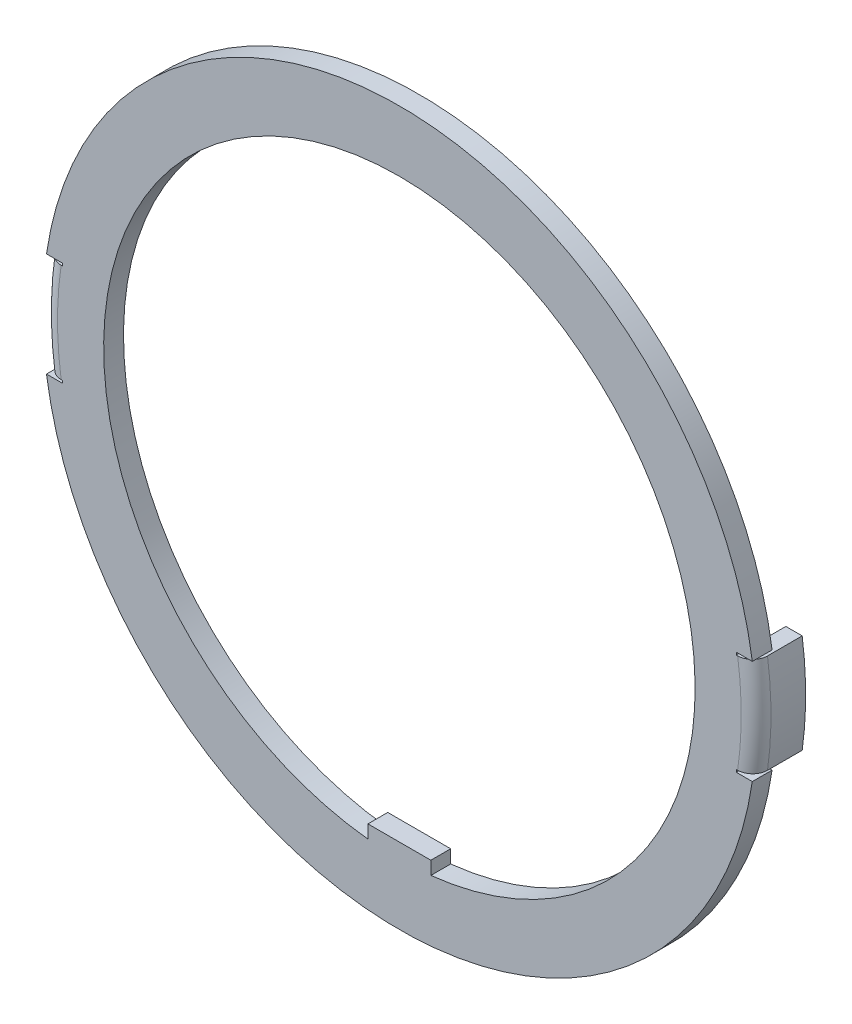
ISO-10303-21;
HEADER;
FILE_DESCRIPTION(('STEP AP214'),'2;1');
FILE_NAME('part.step','',(''),(''),'','','');
FILE_SCHEMA(('AUTOMOTIVE_DESIGN { 1 0 10303 214 1 1 1 1 }'));
ENDSEC;
DATA;
#1=APPLICATION_CONTEXT('core data for automotive mechanical design processes');
#2=APPLICATION_PROTOCOL_DEFINITION('international standard','automotive_design',2000,#1);
#3=PRODUCT_CONTEXT('',#1,'mechanical');
#4=PRODUCT('Part','Part','',(#3));
#5=PRODUCT_RELATED_PRODUCT_CATEGORY('part','',(#4));
#6=PRODUCT_DEFINITION_FORMATION('','',#4);
#7=PRODUCT_DEFINITION_CONTEXT('part definition',#1,'design');
#8=PRODUCT_DEFINITION('design','',#6,#7);
#9=PRODUCT_DEFINITION_SHAPE('','',#8);
#10=(LENGTH_UNIT() NAMED_UNIT(*) SI_UNIT(.MILLI.,.METRE.));
#11=(NAMED_UNIT(*) PLANE_ANGLE_UNIT() SI_UNIT($,.RADIAN.));
#12=(NAMED_UNIT(*) SI_UNIT($,.STERADIAN.) SOLID_ANGLE_UNIT());
#13=UNCERTAINTY_MEASURE_WITH_UNIT(LENGTH_MEASURE(1.E-05),#10,'distance_accuracy_value','');
#14=(GEOMETRIC_REPRESENTATION_CONTEXT(3) GLOBAL_UNCERTAINTY_ASSIGNED_CONTEXT((#13)) GLOBAL_UNIT_ASSIGNED_CONTEXT((#10,
#11,#12)) REPRESENTATION_CONTEXT('',''));
#15=CARTESIAN_POINT('',(0.,0.,0.));
#16=DIRECTION('',(0.,0.,1.));
#17=DIRECTION('',(1.,0.,0.));
#18=AXIS2_PLACEMENT_3D('',#15,#16,#17);
#19=CARTESIAN_POINT('',(0.,0.,1.));
#20=DIRECTION('',(0.,0.,-1.));
#21=DIRECTION('',(-1.,0.,0.));
#22=AXIS2_PLACEMENT_3D('',#19,#20,#21);
#23=CYLINDRICAL_SURFACE('',#22,18.);
#24=CARTESIAN_POINT('',(0.,0.,0.));
#25=DIRECTION('',(0.,0.,1.));
#26=DIRECTION('',(1.,0.,0.));
#27=AXIS2_PLACEMENT_3D('',#24,#25,#26);
#28=CIRCLE('',#27,18.);
#29=CARTESIAN_POINT('',(17.8075651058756,2.62500000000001,0.));
#30=VERTEX_POINT('',#29);
#31=CARTESIAN_POINT('',(-17.8075651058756,2.62500000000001,0.));
#32=VERTEX_POINT('',#31);
#33=EDGE_CURVE('E358',#30,#32,#28,.T.);
#34=ORIENTED_EDGE('',*,*,#33,.T.);
#35=DIRECTION('',(0.,0.,-1.));
#36=VECTOR('',#35,1.);
#37=CARTESIAN_POINT('',(-17.8075651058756,2.62500000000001,1.));
#38=LINE('',#37,#36);
#39=CARTESIAN_POINT('',(-17.8075651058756,2.62500000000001,1.));
#40=VERTEX_POINT('',#39);
#41=EDGE_CURVE('E209',#32,#40,#38,.F.);
#42=ORIENTED_EDGE('',*,*,#41,.T.);
#43=CARTESIAN_POINT('',(0.,0.,1.));
#44=DIRECTION('',(0.,0.,1.));
#45=DIRECTION('',(1.,0.,0.));
#46=AXIS2_PLACEMENT_3D('',#43,#44,#45);
#47=CIRCLE('',#46,18.);
#48=CARTESIAN_POINT('',(17.8075651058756,2.62500000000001,1.));
#49=VERTEX_POINT('',#48);
#50=EDGE_CURVE('E359',#49,#40,#47,.T.);
#51=ORIENTED_EDGE('',*,*,#50,.F.);
#52=DIRECTION('',(0.,0.,-1.));
#53=VECTOR('',#52,1.);
#54=CARTESIAN_POINT('',(17.8075651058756,2.62500000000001,1.));
#55=LINE('',#54,#53);
#56=EDGE_CURVE('E362',#49,#30,#55,.T.);
#57=ORIENTED_EDGE('',*,*,#56,.T.);
#58=EDGE_LOOP('',(#34,#42,#51,#57));
#59=FACE_BOUND('',#58,.T.);
#60=ADVANCED_FACE('F33',(#59),#23,.T.);
#61=DIRECTION('',(0.,0.,1.));
#62=VECTOR('',#61,1.);
#63=CARTESIAN_POINT('',(-17.8255434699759,-2.49999999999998,-1.5));
#64=LINE('',#63,#62);
#65=CARTESIAN_POINT('',(-17.8255434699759,-2.49999999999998,-1.5));
#66=VERTEX_POINT('',#65);
#67=CARTESIAN_POINT('',(-17.8255434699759,-2.49999999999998,0.25));
#68=VERTEX_POINT('',#67);
#69=EDGE_CURVE('E327',#66,#68,#64,.T.);
#70=ORIENTED_EDGE('',*,*,#69,.T.);
#71=CARTESIAN_POINT('',(0.,0.,0.25));
#72=DIRECTION('',(0.,0.,1.));
#73=DIRECTION('',(1.,0.,0.));
#74=AXIS2_PLACEMENT_3D('',#71,#72,#73);
#75=CIRCLE('',#74,18.);
#76=CARTESIAN_POINT('',(-17.8255434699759,2.50000000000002,0.25));
#77=VERTEX_POINT('',#76);
#78=EDGE_CURVE('E401',#68,#77,#75,.F.);
#79=ORIENTED_EDGE('',*,*,#78,.T.);
#80=DIRECTION('',(0.,0.,1.));
#81=VECTOR('',#80,1.);
#82=CARTESIAN_POINT('',(-17.8255434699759,2.50000000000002,-1.5));
#83=LINE('',#82,#81);
#84=CARTESIAN_POINT('',(-17.8255434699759,2.50000000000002,-1.5));
#85=VERTEX_POINT('',#84);
#86=EDGE_CURVE('E322',#85,#77,#83,.T.);
#87=ORIENTED_EDGE('',*,*,#86,.F.);
#88=CARTESIAN_POINT('',(0.,0.,-1.5));
#89=DIRECTION('',(0.,0.,-1.));
#90=DIRECTION('',(1.,0.,0.));
#91=AXIS2_PLACEMENT_3D('',#88,#89,#90);
#92=CIRCLE('',#91,18.);
#93=EDGE_CURVE('E315',#66,#85,#92,.T.);
#94=ORIENTED_EDGE('',*,*,#93,.F.);
#95=EDGE_LOOP('',(#70,#79,#87,#94));
#96=FACE_BOUND('',#95,.T.);
#97=ADVANCED_FACE('F447',(#96),#23,.T.);
#98=DIRECTION('',(0.,0.,1.));
#99=VECTOR('',#98,1.);
#100=CARTESIAN_POINT('',(17.8255434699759,2.50000000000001,-1.5));
#101=LINE('',#100,#99);
#102=CARTESIAN_POINT('',(17.8255434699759,2.50000000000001,-1.5));
#103=VERTEX_POINT('',#102);
#104=CARTESIAN_POINT('',(17.8255434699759,2.50000000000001,0.25));
#105=VERTEX_POINT('',#104);
#106=EDGE_CURVE('E298',#103,#105,#101,.T.);
#107=ORIENTED_EDGE('',*,*,#106,.T.);
#108=CARTESIAN_POINT('',(0.,0.,0.25));
#109=DIRECTION('',(0.,0.,1.));
#110=DIRECTION('',(1.,0.,0.));
#111=AXIS2_PLACEMENT_3D('',#108,#109,#110);
#112=CIRCLE('',#111,18.);
#113=CARTESIAN_POINT('',(17.8255434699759,-2.5,0.25));
#114=VERTEX_POINT('',#113);
#115=EDGE_CURVE('E46',#105,#114,#112,.F.);
#116=ORIENTED_EDGE('',*,*,#115,.T.);
#117=DIRECTION('',(0.,0.,1.));
#118=VECTOR('',#117,1.);
#119=CARTESIAN_POINT('',(17.8255434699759,-2.5,-1.5));
#120=LINE('',#119,#118);
#121=CARTESIAN_POINT('',(17.8255434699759,-2.5,-1.5));
#122=VERTEX_POINT('',#121);
#123=EDGE_CURVE('E308',#122,#114,#120,.T.);
#124=ORIENTED_EDGE('',*,*,#123,.F.);
#125=CARTESIAN_POINT('',(0.,0.,-1.5));
#126=DIRECTION('',(0.,0.,-1.));
#127=DIRECTION('',(-1.,0.,0.));
#128=AXIS2_PLACEMENT_3D('',#125,#126,#127);
#129=CIRCLE('',#128,18.);
#130=EDGE_CURVE('E289',#103,#122,#129,.T.);
#131=ORIENTED_EDGE('',*,*,#130,.F.);
#132=EDGE_LOOP('',(#107,#116,#124,#131));
#133=FACE_BOUND('',#132,.T.);
#134=ADVANCED_FACE('F441',(#133),#23,.T.);
#135=CARTESIAN_POINT('',(0.,0.,0.));
#136=DIRECTION('',(0.,0.,1.));
#137=DIRECTION('',(1.,0.,0.));
#138=AXIS2_PLACEMENT_3D('',#135,#136,#137);
#139=PLANE('',#138);
#140=CARTESIAN_POINT('',(0.,0.,0.));
#141=DIRECTION('',(0.,0.,1.));
#142=DIRECTION('',(1.,0.,0.));
#143=AXIS2_PLACEMENT_3D('',#140,#141,#142);
#144=CIRCLE('',#143,14.9225);
#145=CARTESIAN_POINT('',(1.5875,-14.8378182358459,0.));
#146=VERTEX_POINT('',#145);
#147=CARTESIAN_POINT('',(-1.5875,-14.8378182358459,0.));
#148=VERTEX_POINT('',#147);
#149=EDGE_CURVE('E326',#146,#148,#144,.T.);
#150=ORIENTED_EDGE('',*,*,#149,.T.);
#151=DIRECTION('',(0.,1.,0.));
#152=VECTOR('',#151,1.);
#153=CARTESIAN_POINT('',(-1.5875,-14.8378182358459,0.));
#154=LINE('',#153,#152);
#155=CARTESIAN_POINT('',(-1.5875,-14.1725,0.));
#156=VERTEX_POINT('',#155);
#157=EDGE_CURVE('E341',#148,#156,#154,.T.);
#158=ORIENTED_EDGE('',*,*,#157,.T.);
#159=DIRECTION('',(1.,0.,0.));
#160=VECTOR('',#159,1.);
#161=CARTESIAN_POINT('',(-1.5875,-14.1725,0.));
#162=LINE('',#161,#160);
#163=CARTESIAN_POINT('',(1.5875,-14.1725,0.));
#164=VERTEX_POINT('',#163);
#165=EDGE_CURVE('E344',#156,#164,#162,.T.);
#166=ORIENTED_EDGE('',*,*,#165,.T.);
#167=DIRECTION('',(0.,-1.,0.));
#168=VECTOR('',#167,1.);
#169=CARTESIAN_POINT('',(1.5875,-14.1725,0.));
#170=LINE('',#169,#168);
#171=EDGE_CURVE('E331',#164,#146,#170,.T.);
#172=ORIENTED_EDGE('',*,*,#171,.T.);
#173=EDGE_LOOP('',(#150,#158,#166,#172));
#174=FACE_BOUND('',#173,.T.);
#175=DIRECTION('',(0.,1.,0.));
#176=VECTOR('',#175,1.);
#177=CARTESIAN_POINT('',(-17.0005434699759,2.62500000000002,0.));
#178=LINE('',#177,#176);
#179=CARTESIAN_POINT('',(-17.0005434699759,2.50000000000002,0.));
#180=VERTEX_POINT('',#179);
#181=CARTESIAN_POINT('',(-17.0005434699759,2.62500000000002,0.));
#182=VERTEX_POINT('',#181);
#183=EDGE_CURVE('E203',#180,#182,#178,.T.);
#184=ORIENTED_EDGE('',*,*,#183,.T.);
#185=DIRECTION('',(-1.,0.,0.));
#186=VECTOR('',#185,1.);
#187=CARTESIAN_POINT('',(-18.9461256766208,2.625,0.));
#188=LINE('',#187,#186);
#189=EDGE_CURVE('E213',#182,#32,#188,.T.);
#190=ORIENTED_EDGE('',*,*,#189,.T.);
#191=ORIENTED_EDGE('',*,*,#33,.F.);
#192=DIRECTION('',(-1.,0.,0.));
#193=VECTOR('',#192,1.);
#194=CARTESIAN_POINT('',(18.9461256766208,2.62500000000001,0.));
#195=LINE('',#194,#193);
#196=CARTESIAN_POINT('',(17.0005434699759,2.62500000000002,0.));
#197=VERTEX_POINT('',#196);
#198=EDGE_CURVE('E271',#30,#197,#195,.T.);
#199=ORIENTED_EDGE('',*,*,#198,.T.);
#200=DIRECTION('',(0.,-1.,0.));
#201=VECTOR('',#200,1.);
#202=CARTESIAN_POINT('',(17.0005434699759,2.62500000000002,0.));
#203=LINE('',#202,#201);
#204=CARTESIAN_POINT('',(17.0005434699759,2.50000000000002,0.));
#205=VERTEX_POINT('',#204);
#206=EDGE_CURVE('E274',#197,#205,#203,.T.);
#207=ORIENTED_EDGE('',*,*,#206,.T.);
#208=DIRECTION('',(0.,1.,0.));
#209=VECTOR('',#208,1.);
#210=CARTESIAN_POINT('',(17.0005434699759,2.50000000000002,0.));
#211=LINE('',#210,#209);
#212=CARTESIAN_POINT('',(17.0005434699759,-2.49999999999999,0.));
#213=VERTEX_POINT('',#212);
#214=EDGE_CURVE('E286',#213,#205,#211,.T.);
#215=ORIENTED_EDGE('',*,*,#214,.F.);
#216=DIRECTION('',(0.,-1.,0.));
#217=VECTOR('',#216,1.);
#218=CARTESIAN_POINT('',(17.0005434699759,-2.49999999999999,0.));
#219=LINE('',#218,#217);
#220=CARTESIAN_POINT('',(17.0005434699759,-2.625,0.));
#221=VERTEX_POINT('',#220);
#222=EDGE_CURVE('E252',#213,#221,#219,.T.);
#223=ORIENTED_EDGE('',*,*,#222,.T.);
#224=DIRECTION('',(1.,0.,0.));
#225=VECTOR('',#224,1.);
#226=CARTESIAN_POINT('',(17.0005434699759,-2.625,0.));
#227=LINE('',#226,#225);
#228=CARTESIAN_POINT('',(17.8075651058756,-2.625,0.));
#229=VERTEX_POINT('',#228);
#230=EDGE_CURVE('E255',#221,#229,#227,.T.);
#231=ORIENTED_EDGE('',*,*,#230,.T.);
#232=CARTESIAN_POINT('',(-17.8075651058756,-2.62499999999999,0.));
#233=VERTEX_POINT('',#232);
#234=EDGE_CURVE('E369',#233,#229,#28,.T.);
#235=ORIENTED_EDGE('',*,*,#234,.F.);
#236=DIRECTION('',(1.,0.,0.));
#237=VECTOR('',#236,1.);
#238=CARTESIAN_POINT('',(-17.0005434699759,-2.625,0.));
#239=LINE('',#238,#237);
#240=CARTESIAN_POINT('',(-17.0005434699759,-2.625,0.));
#241=VERTEX_POINT('',#240);
#242=EDGE_CURVE('E234',#233,#241,#239,.T.);
#243=ORIENTED_EDGE('',*,*,#242,.T.);
#244=DIRECTION('',(0.,1.,0.));
#245=VECTOR('',#244,1.);
#246=CARTESIAN_POINT('',(-17.0005434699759,-2.5,0.));
#247=LINE('',#246,#245);
#248=CARTESIAN_POINT('',(-17.0005434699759,-2.5,0.));
#249=VERTEX_POINT('',#248);
#250=EDGE_CURVE('E237',#241,#249,#247,.T.);
#251=ORIENTED_EDGE('',*,*,#250,.T.);
#252=DIRECTION('',(0.,-1.,0.));
#253=VECTOR('',#252,1.);
#254=CARTESIAN_POINT('',(-17.0005434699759,2.50000000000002,0.));
#255=LINE('',#254,#253);
#256=EDGE_CURVE('E224',#180,#249,#255,.T.);
#257=ORIENTED_EDGE('',*,*,#256,.F.);
#258=EDGE_LOOP('',(#184,#190,#191,#199,#207,#215,#223,#231,#235,#243,#251,#257));
#259=FACE_BOUND('',#258,.T.);
#260=ADVANCED_FACE('F221',(#174,#259),#139,.F.);
#261=CARTESIAN_POINT('',(0.,0.,1.));
#262=DIRECTION('',(0.,0.,1.));
#263=DIRECTION('',(1.,0.,0.));
#264=AXIS2_PLACEMENT_3D('',#261,#262,#263);
#265=PLANE('',#264);
#266=DIRECTION('',(1.,0.,0.));
#267=VECTOR('',#266,1.);
#268=CARTESIAN_POINT('',(0.,2.49999999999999,1.));
#269=LINE('',#268,#267);
#270=CARTESIAN_POINT('',(-17.0678791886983,2.50000000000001,1.));
#271=VERTEX_POINT('',#270);
#272=CARTESIAN_POINT('',(-17.0005434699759,2.50000000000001,1.));
#273=VERTEX_POINT('',#272);
#274=EDGE_CURVE('E385',#271,#273,#269,.T.);
#275=ORIENTED_EDGE('',*,*,#274,.F.);
#276=CARTESIAN_POINT('',(0.,0.,1.));
#277=DIRECTION('',(0.,0.,1.));
#278=DIRECTION('',(1.,0.,0.));
#279=AXIS2_PLACEMENT_3D('',#276,#277,#278);
#280=CIRCLE('',#279,17.25);
#281=CARTESIAN_POINT('',(-17.0678791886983,-2.5,1.));
#282=VERTEX_POINT('',#281);
#283=EDGE_CURVE('E392',#271,#282,#280,.T.);
#284=ORIENTED_EDGE('',*,*,#283,.T.);
#285=DIRECTION('',(-1.,0.,0.));
#286=VECTOR('',#285,1.);
#287=CARTESIAN_POINT('',(-17.0005434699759,-2.5,1.));
#288=LINE('',#287,#286);
#289=CARTESIAN_POINT('',(-17.0005434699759,-2.5,1.));
#290=VERTEX_POINT('',#289);
#291=EDGE_CURVE('E233',#290,#282,#288,.T.);
#292=ORIENTED_EDGE('',*,*,#291,.F.);
#293=DIRECTION('',(0.,1.,0.));
#294=VECTOR('',#293,1.);
#295=CARTESIAN_POINT('',(-17.0005434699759,-2.5,1.));
#296=LINE('',#295,#294);
#297=CARTESIAN_POINT('',(-17.0005434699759,-2.625,1.));
#298=VERTEX_POINT('',#297);
#299=EDGE_CURVE('E238',#298,#290,#296,.T.);
#300=ORIENTED_EDGE('',*,*,#299,.F.);
#301=DIRECTION('',(1.,0.,0.));
#302=VECTOR('',#301,1.);
#303=CARTESIAN_POINT('',(-17.0005434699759,-2.625,1.));
#304=LINE('',#303,#302);
#305=CARTESIAN_POINT('',(-17.8075651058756,-2.62499999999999,1.));
#306=VERTEX_POINT('',#305);
#307=EDGE_CURVE('E243',#306,#298,#304,.T.);
#308=ORIENTED_EDGE('',*,*,#307,.F.);
#309=CARTESIAN_POINT('',(17.8075651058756,-2.625,1.));
#310=VERTEX_POINT('',#309);
#311=EDGE_CURVE('E363',#306,#310,#47,.T.);
#312=ORIENTED_EDGE('',*,*,#311,.T.);
#313=DIRECTION('',(1.,0.,0.));
#314=VECTOR('',#313,1.);
#315=CARTESIAN_POINT('',(17.0005434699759,-2.625,1.));
#316=LINE('',#315,#314);
#317=CARTESIAN_POINT('',(17.0005434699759,-2.625,1.));
#318=VERTEX_POINT('',#317);
#319=EDGE_CURVE('E262',#318,#310,#316,.T.);
#320=ORIENTED_EDGE('',*,*,#319,.F.);
#321=DIRECTION('',(0.,-1.,0.));
#322=VECTOR('',#321,1.);
#323=CARTESIAN_POINT('',(17.0005434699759,-2.49999999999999,1.));
#324=LINE('',#323,#322);
#325=CARTESIAN_POINT('',(17.0005434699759,-2.49999999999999,1.));
#326=VERTEX_POINT('',#325);
#327=EDGE_CURVE('E249',#326,#318,#324,.T.);
#328=ORIENTED_EDGE('',*,*,#327,.F.);
#329=DIRECTION('',(-1.,0.,0.));
#330=VECTOR('',#329,1.);
#331=CARTESIAN_POINT('',(17.0005434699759,-2.49999999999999,1.));
#332=LINE('',#331,#330);
#333=CARTESIAN_POINT('',(17.0678791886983,-2.49999999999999,1.));
#334=VERTEX_POINT('',#333);
#335=EDGE_CURVE('E256',#334,#326,#332,.T.);
#336=ORIENTED_EDGE('',*,*,#335,.F.);
#337=CARTESIAN_POINT('',(0.,0.,1.));
#338=DIRECTION('',(0.,0.,1.));
#339=DIRECTION('',(1.,0.,0.));
#340=AXIS2_PLACEMENT_3D('',#337,#338,#339);
#341=CIRCLE('',#340,17.25);
#342=CARTESIAN_POINT('',(17.0678791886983,2.50000000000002,1.));
#343=VERTEX_POINT('',#342);
#344=EDGE_CURVE('E387',#334,#343,#341,.T.);
#345=ORIENTED_EDGE('',*,*,#344,.T.);
#346=DIRECTION('',(1.,0.,0.));
#347=VECTOR('',#346,1.);
#348=CARTESIAN_POINT('',(18.9461256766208,2.50000000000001,1.));
#349=LINE('',#348,#347);
#350=CARTESIAN_POINT('',(17.0005434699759,2.50000000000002,1.));
#351=VERTEX_POINT('',#350);
#352=EDGE_CURVE('E275',#351,#343,#349,.T.);
#353=ORIENTED_EDGE('',*,*,#352,.F.);
#354=DIRECTION('',(0.,-1.,0.));
#355=VECTOR('',#354,1.);
#356=CARTESIAN_POINT('',(17.0005434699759,2.62500000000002,1.));
#357=LINE('',#356,#355);
#358=CARTESIAN_POINT('',(17.0005434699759,2.62500000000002,1.));
#359=VERTEX_POINT('',#358);
#360=EDGE_CURVE('E280',#359,#351,#357,.T.);
#361=ORIENTED_EDGE('',*,*,#360,.F.);
#362=DIRECTION('',(-1.,0.,0.));
#363=VECTOR('',#362,1.);
#364=CARTESIAN_POINT('',(18.9461256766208,2.62500000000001,1.));
#365=LINE('',#364,#363);
#366=EDGE_CURVE('E269',#49,#359,#365,.T.);
#367=ORIENTED_EDGE('',*,*,#366,.F.);
#368=ORIENTED_EDGE('',*,*,#50,.T.);
#369=DIRECTION('',(-1.,0.,0.));
#370=VECTOR('',#369,1.);
#371=CARTESIAN_POINT('',(-18.9461256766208,2.625,1.));
#372=LINE('',#371,#370);
#373=CARTESIAN_POINT('',(-17.0005434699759,2.62500000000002,1.));
#374=VERTEX_POINT('',#373);
#375=EDGE_CURVE('E229',#374,#40,#372,.T.);
#376=ORIENTED_EDGE('',*,*,#375,.F.);
#377=DIRECTION('',(0.,1.,0.));
#378=VECTOR('',#377,1.);
#379=CARTESIAN_POINT('',(-17.0005434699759,2.62500000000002,1.));
#380=LINE('',#379,#378);
#381=EDGE_CURVE('E206',#273,#374,#380,.T.);
#382=ORIENTED_EDGE('',*,*,#381,.F.);
#383=EDGE_LOOP('',(#275,#284,#292,#300,#308,#312,#320,#328,#336,#345,#353,#361,#367,#368,#376,#382));
#384=FACE_BOUND('',#383,.T.);
#385=DIRECTION('',(0.,1.,0.));
#386=VECTOR('',#385,1.);
#387=CARTESIAN_POINT('',(-1.5875,-14.8378182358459,1.));
#388=LINE('',#387,#386);
#389=CARTESIAN_POINT('',(-1.5875,-14.8378182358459,1.));
#390=VERTEX_POINT('',#389);
#391=CARTESIAN_POINT('',(-1.5875,-14.1725,1.));
#392=VERTEX_POINT('',#391);
#393=EDGE_CURVE('E330',#390,#392,#388,.T.);
#394=ORIENTED_EDGE('',*,*,#393,.F.);
#395=CARTESIAN_POINT('',(0.,0.,1.));
#396=DIRECTION('',(0.,0.,1.));
#397=DIRECTION('',(1.,0.,0.));
#398=AXIS2_PLACEMENT_3D('',#395,#396,#397);
#399=CIRCLE('',#398,14.9225);
#400=CARTESIAN_POINT('',(1.5875,-14.8378182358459,1.));
#401=VERTEX_POINT('',#400);
#402=EDGE_CURVE('E328',#401,#390,#399,.T.);
#403=ORIENTED_EDGE('',*,*,#402,.F.);
#404=DIRECTION('',(0.,-1.,0.));
#405=VECTOR('',#404,1.);
#406=CARTESIAN_POINT('',(1.5875,-14.1725,1.));
#407=LINE('',#406,#405);
#408=CARTESIAN_POINT('',(1.5875,-14.1725,1.));
#409=VERTEX_POINT('',#408);
#410=EDGE_CURVE('E336',#409,#401,#407,.T.);
#411=ORIENTED_EDGE('',*,*,#410,.F.);
#412=DIRECTION('',(1.,0.,0.));
#413=VECTOR('',#412,1.);
#414=CARTESIAN_POINT('',(-1.5875,-14.1725,1.));
#415=LINE('',#414,#413);
#416=EDGE_CURVE('E333',#392,#409,#415,.T.);
#417=ORIENTED_EDGE('',*,*,#416,.F.);
#418=EDGE_LOOP('',(#394,#403,#411,#417));
#419=FACE_BOUND('',#418,.T.);
#420=ADVANCED_FACE('F436',(#384,#419),#265,.T.);
#421=ORIENTED_EDGE('',*,*,#311,.F.);
#422=DIRECTION('',(0.,0.,-1.));
#423=VECTOR('',#422,1.);
#424=CARTESIAN_POINT('',(-17.8075651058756,-2.62499999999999,1.));
#425=LINE('',#424,#423);
#426=EDGE_CURVE('E380',#306,#233,#425,.T.);
#427=ORIENTED_EDGE('',*,*,#426,.T.);
#428=ORIENTED_EDGE('',*,*,#234,.T.);
#429=DIRECTION('',(0.,0.,-1.));
#430=VECTOR('',#429,1.);
#431=CARTESIAN_POINT('',(17.8075651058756,-2.625,1.));
#432=LINE('',#431,#430);
#433=EDGE_CURVE('E378',#229,#310,#432,.F.);
#434=ORIENTED_EDGE('',*,*,#433,.T.);
#435=EDGE_LOOP('',(#421,#427,#428,#434));
#436=FACE_BOUND('',#435,.T.);
#437=ADVANCED_FACE('F434',(#436),#23,.T.);
#438=CARTESIAN_POINT('',(0.,0.,1.));
#439=DIRECTION('',(0.,0.,-1.));
#440=DIRECTION('',(-1.,0.,0.));
#441=AXIS2_PLACEMENT_3D('',#438,#439,#440);
#442=CYLINDRICAL_SURFACE('',#441,14.9225);
#443=ORIENTED_EDGE('',*,*,#149,.F.);
#444=DIRECTION('',(0.,0.,-1.));
#445=VECTOR('',#444,1.);
#446=CARTESIAN_POINT('',(1.5875,-14.8378182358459,1.));
#447=LINE('',#446,#445);
#448=EDGE_CURVE('E338',#401,#146,#447,.T.);
#449=ORIENTED_EDGE('',*,*,#448,.F.);
#450=ORIENTED_EDGE('',*,*,#402,.T.);
#451=DIRECTION('',(0.,0.,-1.));
#452=VECTOR('',#451,1.);
#453=CARTESIAN_POINT('',(-1.5875,-14.8378182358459,1.));
#454=LINE('',#453,#452);
#455=EDGE_CURVE('E355',#390,#148,#454,.T.);
#456=ORIENTED_EDGE('',*,*,#455,.T.);
#457=EDGE_LOOP('',(#443,#449,#450,#456));
#458=FACE_BOUND('',#457,.T.);
#459=ADVANCED_FACE('F430',(#458),#442,.F.);
#460=CARTESIAN_POINT('',(-1.5875,-14.8378182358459,1.));
#461=DIRECTION('',(-1.,0.,0.));
#462=DIRECTION('',(0.,0.,1.));
#463=AXIS2_PLACEMENT_3D('',#460,#461,#462);
#464=PLANE('',#463);
#465=ORIENTED_EDGE('',*,*,#157,.F.);
#466=ORIENTED_EDGE('',*,*,#455,.F.);
#467=ORIENTED_EDGE('',*,*,#393,.T.);
#468=DIRECTION('',(0.,0.,-1.));
#469=VECTOR('',#468,1.);
#470=CARTESIAN_POINT('',(-1.5875,-14.1725,1.));
#471=LINE('',#470,#469);
#472=EDGE_CURVE('E353',#392,#156,#471,.T.);
#473=ORIENTED_EDGE('',*,*,#472,.T.);
#474=EDGE_LOOP('',(#465,#466,#467,#473));
#475=FACE_BOUND('',#474,.T.);
#476=ADVANCED_FACE('F426',(#475),#464,.T.);
#477=CARTESIAN_POINT('',(-1.5875,-14.1725,1.));
#478=DIRECTION('',(0.,1.,0.));
#479=DIRECTION('',(0.,0.,1.));
#480=AXIS2_PLACEMENT_3D('',#477,#478,#479);
#481=PLANE('',#480);
#482=ORIENTED_EDGE('',*,*,#165,.F.);
#483=ORIENTED_EDGE('',*,*,#472,.F.);
#484=ORIENTED_EDGE('',*,*,#416,.T.);
#485=DIRECTION('',(0.,0.,-1.));
#486=VECTOR('',#485,1.);
#487=CARTESIAN_POINT('',(1.5875,-14.1725,1.));
#488=LINE('',#487,#486);
#489=EDGE_CURVE('E351',#409,#164,#488,.T.);
#490=ORIENTED_EDGE('',*,*,#489,.T.);
#491=EDGE_LOOP('',(#482,#483,#484,#490));
#492=FACE_BOUND('',#491,.T.);
#493=ADVANCED_FACE('F422',(#492),#481,.T.);
#494=CARTESIAN_POINT('',(1.5875,-14.1725,1.));
#495=DIRECTION('',(1.,0.,0.));
#496=DIRECTION('',(0.,0.,-1.));
#497=AXIS2_PLACEMENT_3D('',#494,#495,#496);
#498=PLANE('',#497);
#499=ORIENTED_EDGE('',*,*,#171,.F.);
#500=ORIENTED_EDGE('',*,*,#489,.F.);
#501=ORIENTED_EDGE('',*,*,#410,.T.);
#502=ORIENTED_EDGE('',*,*,#448,.T.);
#503=EDGE_LOOP('',(#499,#500,#501,#502));
#504=FACE_BOUND('',#503,.T.);
#505=ADVANCED_FACE('F418',(#504),#498,.T.);
#506=CARTESIAN_POINT('',(-17.0005434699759,2.50000000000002,-1.5));
#507=DIRECTION('',(-1.,0.,0.));
#508=DIRECTION('',(0.,0.,1.));
#509=AXIS2_PLACEMENT_3D('',#506,#507,#508);
#510=PLANE('',#509);
#511=ORIENTED_EDGE('',*,*,#256,.T.);
#512=DIRECTION('',(0.,0.,1.));
#513=VECTOR('',#512,1.);
#514=CARTESIAN_POINT('',(-17.0005434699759,-2.49999999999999,-1.5));
#515=LINE('',#514,#513);
#516=CARTESIAN_POINT('',(-17.0005434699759,-2.49999999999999,-1.5));
#517=VERTEX_POINT('',#516);
#518=EDGE_CURVE('E323',#517,#249,#515,.T.);
#519=ORIENTED_EDGE('',*,*,#518,.F.);
#520=DIRECTION('',(0.,-1.,0.));
#521=VECTOR('',#520,1.);
#522=CARTESIAN_POINT('',(-17.0005434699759,2.50000000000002,-1.5));
#523=LINE('',#522,#521);
#524=CARTESIAN_POINT('',(-17.0005434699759,2.50000000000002,-1.5));
#525=VERTEX_POINT('',#524);
#526=EDGE_CURVE('E310',#525,#517,#523,.T.);
#527=ORIENTED_EDGE('',*,*,#526,.F.);
#528=DIRECTION('',(0.,0.,1.));
#529=VECTOR('',#528,1.);
#530=CARTESIAN_POINT('',(-17.0005434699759,2.50000000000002,-1.5));
#531=LINE('',#530,#529);
#532=EDGE_CURVE('E319',#525,#180,#531,.T.);
#533=ORIENTED_EDGE('',*,*,#532,.T.);
#534=EDGE_LOOP('',(#511,#519,#527,#533));
#535=FACE_BOUND('',#534,.T.);
#536=ADVANCED_FACE('F412',(#535),#510,.F.);
#537=CARTESIAN_POINT('',(-17.0005434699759,-2.49999999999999,-1.5));
#538=DIRECTION('',(0.,1.,0.));
#539=DIRECTION('',(0.,0.,1.));
#540=AXIS2_PLACEMENT_3D('',#537,#538,#539);
#541=PLANE('',#540);
#542=ORIENTED_EDGE('',*,*,#291,.T.);
#543=CARTESIAN_POINT('',(-17.0678791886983,-2.49999999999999,1.));
#544=CARTESIAN_POINT('',(-17.1108304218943,-2.49999999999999,1.00003446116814));
#545=CARTESIAN_POINT('',(-17.1537740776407,-2.49999999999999,0.996389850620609));
#546=CARTESIAN_POINT('',(-17.2384327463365,-2.49999999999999,0.981989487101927));
#547=CARTESIAN_POINT('',(-17.2801483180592,-2.49999999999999,0.971237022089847));
#548=CARTESIAN_POINT('',(-17.3612036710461,-2.49999999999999,0.942858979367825));
#549=CARTESIAN_POINT('',(-17.4005420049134,-2.49999999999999,0.925229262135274));
#550=CARTESIAN_POINT('',(-17.4756702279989,-2.49999999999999,0.883588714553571));
#551=CARTESIAN_POINT('',(-17.5114610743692,-2.49999999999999,0.859579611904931));
#552=CARTESIAN_POINT('',(-17.5782807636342,-2.49999999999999,0.805976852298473));
#553=CARTESIAN_POINT('',(-17.6093331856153,-2.49999999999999,0.776412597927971));
#554=CARTESIAN_POINT('',(-17.6659813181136,-2.49999999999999,0.71243725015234));
#555=CARTESIAN_POINT('',(-17.6915760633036,-2.49999999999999,0.678025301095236));
#556=CARTESIAN_POINT('',(-17.7363127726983,-2.49999999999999,0.605692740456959));
#557=CARTESIAN_POINT('',(-17.7555137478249,-2.49999999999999,0.567808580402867));
#558=CARTESIAN_POINT('',(-17.7872080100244,-2.49999999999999,0.489344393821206));
#559=CARTESIAN_POINT('',(-17.7997061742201,-2.49999999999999,0.44876635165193));
#560=CARTESIAN_POINT('',(-17.8142760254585,-2.49999999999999,0.381584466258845));
#561=CARTESIAN_POINT('',(-17.8184988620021,-2.49999999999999,0.355427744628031));
#562=CARTESIAN_POINT('',(-17.8241319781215,-2.49999999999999,0.302851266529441));
#563=CARTESIAN_POINT('',(-17.8255462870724,-2.49999999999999,0.27643194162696));
#564=CARTESIAN_POINT('',(-17.8255434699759,-2.49999999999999,0.249999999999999));
#565=B_SPLINE_CURVE_WITH_KNOTS('',3,(#543,#544,#545,#546,#547,#548,#549,#550,#551,#552,#553,
#554,#555,#556,#557,#558,#559,#560,#561,#562,#563,#564),.UNSPECIFIED.,.F.,.F.,(4,2,2,2,2,2,2,2,
2,2,4),(0.,0.12868900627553,0.257318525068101,0.386025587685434,0.514697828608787,
0.642707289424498,0.770739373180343,0.89755473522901,1.024277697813,1.10362502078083,
1.18285842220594),.UNSPECIFIED.);
#566=EDGE_CURVE('E395',#282,#68,#565,.T.);
#567=ORIENTED_EDGE('',*,*,#566,.T.);
#568=ORIENTED_EDGE('',*,*,#69,.F.);
#569=DIRECTION('',(-1.,0.,0.));
#570=VECTOR('',#569,1.);
#571=CARTESIAN_POINT('',(-17.0005434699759,-2.49999999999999,-1.5));
#572=LINE('',#571,#570);
#573=EDGE_CURVE('E313',#517,#66,#572,.T.);
#574=ORIENTED_EDGE('',*,*,#573,.F.);
#575=ORIENTED_EDGE('',*,*,#518,.T.);
#576=DIRECTION('',(0.,0.,1.));
#577=VECTOR('',#576,1.);
#578=CARTESIAN_POINT('',(-17.0005434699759,-2.5,0.));
#579=LINE('',#578,#577);
#580=EDGE_CURVE('E247',#249,#290,#579,.T.);
#581=ORIENTED_EDGE('',*,*,#580,.T.);
#582=EDGE_LOOP('',(#542,#567,#568,#574,#575,#581));
#583=FACE_BOUND('',#582,.T.);
#584=ADVANCED_FACE('F406',(#583),#541,.F.);
#585=CARTESIAN_POINT('',(-17.0005434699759,2.50000000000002,-1.5));
#586=DIRECTION('',(0.,-1.,0.));
#587=DIRECTION('',(0.,0.,-1.));
#588=AXIS2_PLACEMENT_3D('',#585,#586,#587);
#589=PLANE('',#588);
#590=ORIENTED_EDGE('',*,*,#86,.T.);
#591=CARTESIAN_POINT('',(-17.8255434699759,2.50000000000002,0.25));
#592=CARTESIAN_POINT('',(-17.8255809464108,2.50000000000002,0.29189395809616));
#593=CARTESIAN_POINT('',(-17.8220012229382,2.50000000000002,0.333774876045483));
#594=CARTESIAN_POINT('',(-17.8078866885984,2.50000000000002,0.416304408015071));
#595=CARTESIAN_POINT('',(-17.7973592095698,2.50000000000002,0.456954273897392));
#596=CARTESIAN_POINT('',(-17.7696220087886,2.50000000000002,0.535924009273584));
#597=CARTESIAN_POINT('',(-17.7524096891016,2.50000000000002,0.574242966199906));
#598=CARTESIAN_POINT('',(-17.7118266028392,2.50000000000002,0.647459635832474));
#599=CARTESIAN_POINT('',(-17.6884564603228,2.50000000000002,0.682357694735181));
#600=CARTESIAN_POINT('',(-17.6361265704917,2.50000000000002,0.747912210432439));
#601=CARTESIAN_POINT('',(-17.6071440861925,2.50000000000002,0.778550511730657));
#602=CARTESIAN_POINT('',(-17.5444829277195,2.50000000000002,0.834586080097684));
#603=CARTESIAN_POINT('',(-17.5108032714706,2.50000000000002,0.859982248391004));
#604=CARTESIAN_POINT('',(-17.4393750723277,2.50000000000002,0.905060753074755));
#605=CARTESIAN_POINT('',(-17.4015912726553,2.50000000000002,0.92468716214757));
#606=CARTESIAN_POINT('',(-17.3232917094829,2.50000000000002,0.957376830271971));
#607=CARTESIAN_POINT('',(-17.2827771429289,2.50000000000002,0.970442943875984));
#608=CARTESIAN_POINT('',(-17.2130300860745,2.50000000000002,0.986687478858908));
#609=CARTESIAN_POINT('',(-17.1842057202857,2.50000000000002,0.991676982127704));
#610=CARTESIAN_POINT('',(-17.1262175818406,2.50000000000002,0.998333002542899));
#611=CARTESIAN_POINT('',(-17.0970543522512,2.50000000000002,1.0000042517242));
#612=CARTESIAN_POINT('',(-17.0678791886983,2.50000000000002,1.));
#613=B_SPLINE_CURVE_WITH_KNOTS('',3,(#591,#592,#593,#594,#595,#596,#597,#598,#599,#600,#601,
#602,#603,#604,#605,#606,#607,#608,#609,#610,#611,#612),.UNSPECIFIED.,.F.,.F.,(4,2,2,2,2,2,2,2,
2,2,4),(0.,0.125510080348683,0.250887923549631,0.376314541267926,0.501728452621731,
0.627661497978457,0.753620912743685,0.880763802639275,1.00785132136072,1.09543069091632,
1.1828850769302),.UNSPECIFIED.);
#614=EDGE_CURVE('E459',#77,#271,#613,.T.);
#615=ORIENTED_EDGE('',*,*,#614,.T.);
#616=ORIENTED_EDGE('',*,*,#274,.T.);
#617=DIRECTION('',(0.,0.,1.));
#618=VECTOR('',#617,1.);
#619=CARTESIAN_POINT('',(-17.0005434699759,2.50000000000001,0.));
#620=LINE('',#619,#618);
#621=EDGE_CURVE('E210',#180,#273,#620,.T.);
#622=ORIENTED_EDGE('',*,*,#621,.F.);
#623=ORIENTED_EDGE('',*,*,#532,.F.);
#624=DIRECTION('',(1.,0.,0.));
#625=VECTOR('',#624,1.);
#626=CARTESIAN_POINT('',(-17.0005434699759,2.50000000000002,-1.5));
#627=LINE('',#626,#625);
#628=EDGE_CURVE('E317',#85,#525,#627,.T.);
#629=ORIENTED_EDGE('',*,*,#628,.F.);
#630=EDGE_LOOP('',(#590,#615,#616,#622,#623,#629));
#631=FACE_BOUND('',#630,.T.);
#632=ADVANCED_FACE('F411',(#631),#589,.F.);
#633=CARTESIAN_POINT('',(0.,0.,-1.5));
#634=DIRECTION('',(0.,0.,1.));
#635=DIRECTION('',(1.,0.,0.));
#636=AXIS2_PLACEMENT_3D('',#633,#634,#635);
#637=PLANE('',#636);
#638=ORIENTED_EDGE('',*,*,#526,.T.);
#639=ORIENTED_EDGE('',*,*,#573,.T.);
#640=ORIENTED_EDGE('',*,*,#93,.T.);
#641=ORIENTED_EDGE('',*,*,#628,.T.);
#642=EDGE_LOOP('',(#638,#639,#640,#641));
#643=FACE_BOUND('',#642,.T.);
#644=ADVANCED_FACE('F481',(#643),#637,.F.);
#645=CARTESIAN_POINT('',(17.0005434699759,-2.49999999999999,-1.5));
#646=DIRECTION('',(0.,1.,0.));
#647=DIRECTION('',(-1.,0.,0.));
#648=AXIS2_PLACEMENT_3D('',#645,#646,#647);
#649=PLANE('',#648);
#650=ORIENTED_EDGE('',*,*,#123,.T.);
#651=CARTESIAN_POINT('',(17.8255434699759,-2.5,0.25));
#652=CARTESIAN_POINT('',(17.8255809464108,-2.5,0.29189395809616));
#653=CARTESIAN_POINT('',(17.8220012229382,-2.5,0.333774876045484));
#654=CARTESIAN_POINT('',(17.8078866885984,-2.5,0.416304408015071));
#655=CARTESIAN_POINT('',(17.7973592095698,-2.49999999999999,0.456954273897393));
#656=CARTESIAN_POINT('',(17.7696220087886,-2.49999999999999,0.535924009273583));
#657=CARTESIAN_POINT('',(17.7524096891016,-2.49999999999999,0.574242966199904));
#658=CARTESIAN_POINT('',(17.7118266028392,-2.49999999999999,0.647459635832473));
#659=CARTESIAN_POINT('',(17.6884564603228,-2.49999999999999,0.682357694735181));
#660=CARTESIAN_POINT('',(17.6361265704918,-2.49999999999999,0.74791221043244));
#661=CARTESIAN_POINT('',(17.6071440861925,-2.49999999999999,0.778550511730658));
#662=CARTESIAN_POINT('',(17.5444829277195,-2.49999999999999,0.834586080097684));
#663=CARTESIAN_POINT('',(17.5108032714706,-2.49999999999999,0.859982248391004));
#664=CARTESIAN_POINT('',(17.4393750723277,-2.49999999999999,0.905060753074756));
#665=CARTESIAN_POINT('',(17.4015912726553,-2.49999999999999,0.924687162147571));
#666=CARTESIAN_POINT('',(17.3232917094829,-2.49999999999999,0.957376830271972));
#667=CARTESIAN_POINT('',(17.2827771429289,-2.49999999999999,0.970442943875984));
#668=CARTESIAN_POINT('',(17.2130300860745,-2.49999999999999,0.986687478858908));
#669=CARTESIAN_POINT('',(17.1842057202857,-2.49999999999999,0.991676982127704));
#670=CARTESIAN_POINT('',(17.1262175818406,-2.49999999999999,0.9983330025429));
#671=CARTESIAN_POINT('',(17.0970543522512,-2.49999999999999,1.00000425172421));
#672=CARTESIAN_POINT('',(17.0678791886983,-2.49999999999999,1.));
#673=B_SPLINE_CURVE_WITH_KNOTS('',3,(#651,#652,#653,#654,#655,#656,#657,#658,#659,#660,#661,
#662,#663,#664,#665,#666,#667,#668,#669,#670,#671,#672),.UNSPECIFIED.,.F.,.F.,(4,2,2,2,2,2,2,2,
2,2,4),(0.,0.125510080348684,0.250887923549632,0.376314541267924,0.501728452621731,
0.627661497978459,0.753620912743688,0.880763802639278,1.00785132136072,1.09543069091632,
1.18288507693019),.UNSPECIFIED.);
#674=EDGE_CURVE('E11',#114,#334,#673,.T.);
#675=ORIENTED_EDGE('',*,*,#674,.T.);
#676=ORIENTED_EDGE('',*,*,#335,.T.);
#677=DIRECTION('',(0.,0.,1.));
#678=VECTOR('',#677,1.);
#679=CARTESIAN_POINT('',(17.0005434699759,-2.49999999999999,0.));
#680=LINE('',#679,#678);
#681=EDGE_CURVE('E266',#213,#326,#680,.T.);
#682=ORIENTED_EDGE('',*,*,#681,.F.);
#683=DIRECTION('',(0.,0.,1.));
#684=VECTOR('',#683,1.);
#685=CARTESIAN_POINT('',(17.0005434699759,-2.49999999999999,-1.5));
#686=LINE('',#685,#684);
#687=CARTESIAN_POINT('',(17.0005434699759,-2.49999999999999,-1.5));
#688=VERTEX_POINT('',#687);
#689=EDGE_CURVE('E305',#688,#213,#686,.T.);
#690=ORIENTED_EDGE('',*,*,#689,.F.);
#691=DIRECTION('',(-1.,0.,0.));
#692=VECTOR('',#691,1.);
#693=CARTESIAN_POINT('',(17.0005434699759,-2.49999999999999,-1.5));
#694=LINE('',#693,#692);
#695=EDGE_CURVE('E292',#122,#688,#694,.T.);
#696=ORIENTED_EDGE('',*,*,#695,.F.);
#697=EDGE_LOOP('',(#650,#675,#676,#682,#690,#696));
#698=FACE_BOUND('',#697,.T.);
#699=ADVANCED_FACE('F477',(#698),#649,.F.);
#700=CARTESIAN_POINT('',(17.0005434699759,2.50000000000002,-1.5));
#701=DIRECTION('',(1.,0.,0.));
#702=DIRECTION('',(0.,0.,-1.));
#703=AXIS2_PLACEMENT_3D('',#700,#701,#702);
#704=PLANE('',#703);
#705=ORIENTED_EDGE('',*,*,#214,.T.);
#706=DIRECTION('',(0.,0.,1.));
#707=VECTOR('',#706,1.);
#708=CARTESIAN_POINT('',(17.0005434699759,2.50000000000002,-1.5));
#709=LINE('',#708,#707);
#710=CARTESIAN_POINT('',(17.0005434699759,2.50000000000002,-1.5));
#711=VERTEX_POINT('',#710);
#712=EDGE_CURVE('E302',#711,#205,#709,.T.);
#713=ORIENTED_EDGE('',*,*,#712,.F.);
#714=DIRECTION('',(0.,1.,0.));
#715=VECTOR('',#714,1.);
#716=CARTESIAN_POINT('',(17.0005434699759,2.50000000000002,-1.5));
#717=LINE('',#716,#715);
#718=EDGE_CURVE('E294',#688,#711,#717,.T.);
#719=ORIENTED_EDGE('',*,*,#718,.F.);
#720=ORIENTED_EDGE('',*,*,#689,.T.);
#721=EDGE_LOOP('',(#705,#713,#719,#720));
#722=FACE_BOUND('',#721,.T.);
#723=ADVANCED_FACE('F474',(#722),#704,.F.);
#724=CARTESIAN_POINT('',(17.0005434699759,2.50000000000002,-1.5));
#725=DIRECTION('',(0.,-1.,0.));
#726=DIRECTION('',(1.,0.,0.));
#727=AXIS2_PLACEMENT_3D('',#724,#725,#726);
#728=PLANE('',#727);
#729=ORIENTED_EDGE('',*,*,#352,.T.);
#730=CARTESIAN_POINT('',(17.0678791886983,2.50000000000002,1.));
#731=CARTESIAN_POINT('',(17.1108304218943,2.50000000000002,1.00003446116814));
#732=CARTESIAN_POINT('',(17.1537740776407,2.50000000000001,0.996389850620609));
#733=CARTESIAN_POINT('',(17.2384327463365,2.50000000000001,0.981989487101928));
#734=CARTESIAN_POINT('',(17.2801483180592,2.50000000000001,0.971237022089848));
#735=CARTESIAN_POINT('',(17.3612036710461,2.50000000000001,0.942858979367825));
#736=CARTESIAN_POINT('',(17.4005420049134,2.50000000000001,0.925229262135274));
#737=CARTESIAN_POINT('',(17.4756702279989,2.50000000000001,0.883588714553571));
#738=CARTESIAN_POINT('',(17.5114610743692,2.50000000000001,0.859579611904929));
#739=CARTESIAN_POINT('',(17.5782807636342,2.50000000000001,0.80597685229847));
#740=CARTESIAN_POINT('',(17.6093331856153,2.50000000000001,0.776412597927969));
#741=CARTESIAN_POINT('',(17.6659813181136,2.50000000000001,0.712437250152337));
#742=CARTESIAN_POINT('',(17.6915760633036,2.50000000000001,0.678025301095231));
#743=CARTESIAN_POINT('',(17.7363127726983,2.50000000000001,0.605692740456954));
#744=CARTESIAN_POINT('',(17.7555137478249,2.50000000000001,0.567808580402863));
#745=CARTESIAN_POINT('',(17.7872080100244,2.50000000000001,0.489344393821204));
#746=CARTESIAN_POINT('',(17.7997061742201,2.50000000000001,0.448766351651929));
#747=CARTESIAN_POINT('',(17.8142760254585,2.50000000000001,0.381584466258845));
#748=CARTESIAN_POINT('',(17.8184988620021,2.50000000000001,0.35542774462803));
#749=CARTESIAN_POINT('',(17.8241319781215,2.50000000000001,0.302851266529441));
#750=CARTESIAN_POINT('',(17.8255462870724,2.50000000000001,0.27643194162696));
#751=CARTESIAN_POINT('',(17.8255434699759,2.50000000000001,0.249999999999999));
#752=B_SPLINE_CURVE_WITH_KNOTS('',3,(#730,#731,#732,#733,#734,#735,#736,#737,#738,#739,#740,
#741,#742,#743,#744,#745,#746,#747,#748,#749,#750,#751),.UNSPECIFIED.,.F.,.F.,(4,2,2,2,2,2,2,2,
2,2,4),(0.,0.128689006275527,0.257318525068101,0.386025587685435,0.514697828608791,
0.642707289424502,0.770739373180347,0.897554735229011,1.024277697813,1.10362502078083,
1.18285842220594),.UNSPECIFIED.);
#753=EDGE_CURVE('E60',#343,#105,#752,.T.);
#754=ORIENTED_EDGE('',*,*,#753,.T.);
#755=ORIENTED_EDGE('',*,*,#106,.F.);
#756=DIRECTION('',(1.,0.,0.));
#757=VECTOR('',#756,1.);
#758=CARTESIAN_POINT('',(17.0005434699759,2.50000000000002,-1.5));
#759=LINE('',#758,#757);
#760=EDGE_CURVE('E296',#711,#103,#759,.T.);
#761=ORIENTED_EDGE('',*,*,#760,.F.);
#762=ORIENTED_EDGE('',*,*,#712,.T.);
#763=DIRECTION('',(0.,0.,1.));
#764=VECTOR('',#763,1.);
#765=CARTESIAN_POINT('',(17.0005434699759,2.50000000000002,0.));
#766=LINE('',#765,#764);
#767=EDGE_CURVE('E284',#205,#351,#766,.T.);
#768=ORIENTED_EDGE('',*,*,#767,.T.);
#769=EDGE_LOOP('',(#729,#754,#755,#761,#762,#768));
#770=FACE_BOUND('',#769,.T.);
#771=ADVANCED_FACE('F468',(#770),#728,.F.);
#772=CARTESIAN_POINT('',(0.,0.,-1.5));
#773=DIRECTION('',(0.,0.,-1.));
#774=DIRECTION('',(-1.,0.,0.));
#775=AXIS2_PLACEMENT_3D('',#772,#773,#774);
#776=PLANE('',#775);
#777=ORIENTED_EDGE('',*,*,#130,.T.);
#778=ORIENTED_EDGE('',*,*,#695,.T.);
#779=ORIENTED_EDGE('',*,*,#718,.T.);
#780=ORIENTED_EDGE('',*,*,#760,.T.);
#781=EDGE_LOOP('',(#777,#778,#779,#780));
#782=FACE_BOUND('',#781,.T.);
#783=ADVANCED_FACE('F473',(#782),#776,.T.);
#784=CARTESIAN_POINT('',(18.9461256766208,2.62500000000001,0.));
#785=DIRECTION('',(0.,1.,0.));
#786=DIRECTION('',(-1.,0.,0.));
#787=AXIS2_PLACEMENT_3D('',#784,#785,#786);
#788=PLANE('',#787);
#789=ORIENTED_EDGE('',*,*,#366,.T.);
#790=DIRECTION('',(0.,0.,1.));
#791=VECTOR('',#790,1.);
#792=CARTESIAN_POINT('',(17.0005434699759,2.62500000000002,0.));
#793=LINE('',#792,#791);
#794=EDGE_CURVE('E278',#197,#359,#793,.T.);
#795=ORIENTED_EDGE('',*,*,#794,.F.);
#796=ORIENTED_EDGE('',*,*,#198,.F.);
#797=ORIENTED_EDGE('',*,*,#56,.F.);
#798=EDGE_LOOP('',(#789,#795,#796,#797));
#799=FACE_BOUND('',#798,.T.);
#800=ADVANCED_FACE('F508',(#799),#788,.F.);
#801=CARTESIAN_POINT('',(17.0005434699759,2.62500000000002,0.));
#802=DIRECTION('',(-1.,0.,0.));
#803=DIRECTION('',(0.,0.,1.));
#804=AXIS2_PLACEMENT_3D('',#801,#802,#803);
#805=PLANE('',#804);
#806=ORIENTED_EDGE('',*,*,#360,.T.);
#807=ORIENTED_EDGE('',*,*,#767,.F.);
#808=ORIENTED_EDGE('',*,*,#206,.F.);
#809=ORIENTED_EDGE('',*,*,#794,.T.);
#810=EDGE_LOOP('',(#806,#807,#808,#809));
#811=FACE_BOUND('',#810,.T.);
#812=ADVANCED_FACE('F511',(#811),#805,.F.);
#813=CARTESIAN_POINT('',(17.0005434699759,-2.625,0.));
#814=DIRECTION('',(0.,-1.,0.));
#815=DIRECTION('',(1.,0.,0.));
#816=AXIS2_PLACEMENT_3D('',#813,#814,#815);
#817=PLANE('',#816);
#818=ORIENTED_EDGE('',*,*,#230,.F.);
#819=DIRECTION('',(0.,0.,1.));
#820=VECTOR('',#819,1.);
#821=CARTESIAN_POINT('',(17.0005434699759,-2.625,0.));
#822=LINE('',#821,#820);
#823=EDGE_CURVE('E259',#221,#318,#822,.T.);
#824=ORIENTED_EDGE('',*,*,#823,.T.);
#825=ORIENTED_EDGE('',*,*,#319,.T.);
#826=ORIENTED_EDGE('',*,*,#433,.F.);
#827=EDGE_LOOP('',(#818,#824,#825,#826));
#828=FACE_BOUND('',#827,.T.);
#829=ADVANCED_FACE('F525',(#828),#817,.F.);
#830=CARTESIAN_POINT('',(17.0005434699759,-2.49999999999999,0.));
#831=DIRECTION('',(-1.,0.,0.));
#832=DIRECTION('',(0.,0.,1.));
#833=AXIS2_PLACEMENT_3D('',#830,#831,#832);
#834=PLANE('',#833);
#835=ORIENTED_EDGE('',*,*,#327,.T.);
#836=ORIENTED_EDGE('',*,*,#823,.F.);
#837=ORIENTED_EDGE('',*,*,#222,.F.);
#838=ORIENTED_EDGE('',*,*,#681,.T.);
#839=EDGE_LOOP('',(#835,#836,#837,#838));
#840=FACE_BOUND('',#839,.T.);
#841=ADVANCED_FACE('F519',(#840),#834,.F.);
#842=CARTESIAN_POINT('',(-17.0005434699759,-2.625,0.));
#843=DIRECTION('',(0.,-1.,0.));
#844=DIRECTION('',(1.,0.,0.));
#845=AXIS2_PLACEMENT_3D('',#842,#843,#844);
#846=PLANE('',#845);
#847=ORIENTED_EDGE('',*,*,#307,.T.);
#848=DIRECTION('',(0.,0.,1.));
#849=VECTOR('',#848,1.);
#850=CARTESIAN_POINT('',(-17.0005434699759,-2.625,0.));
#851=LINE('',#850,#849);
#852=EDGE_CURVE('E240',#241,#298,#851,.T.);
#853=ORIENTED_EDGE('',*,*,#852,.F.);
#854=ORIENTED_EDGE('',*,*,#242,.F.);
#855=ORIENTED_EDGE('',*,*,#426,.F.);
#856=EDGE_LOOP('',(#847,#853,#854,#855));
#857=FACE_BOUND('',#856,.T.);
#858=ADVANCED_FACE('F532',(#857),#846,.F.);
#859=CARTESIAN_POINT('',(-17.0005434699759,-2.5,0.));
#860=DIRECTION('',(1.,0.,0.));
#861=DIRECTION('',(0.,0.,-1.));
#862=AXIS2_PLACEMENT_3D('',#859,#860,#861);
#863=PLANE('',#862);
#864=ORIENTED_EDGE('',*,*,#299,.T.);
#865=ORIENTED_EDGE('',*,*,#580,.F.);
#866=ORIENTED_EDGE('',*,*,#250,.F.);
#867=ORIENTED_EDGE('',*,*,#852,.T.);
#868=EDGE_LOOP('',(#864,#865,#866,#867));
#869=FACE_BOUND('',#868,.T.);
#870=ADVANCED_FACE('F615',(#869),#863,.F.);
#871=CARTESIAN_POINT('',(-18.9461256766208,2.625,0.));
#872=DIRECTION('',(0.,1.,0.));
#873=DIRECTION('',(-1.,0.,0.));
#874=AXIS2_PLACEMENT_3D('',#871,#872,#873);
#875=PLANE('',#874);
#876=ORIENTED_EDGE('',*,*,#189,.F.);
#877=DIRECTION('',(0.,0.,1.));
#878=VECTOR('',#877,1.);
#879=CARTESIAN_POINT('',(-17.0005434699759,2.62500000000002,0.));
#880=LINE('',#879,#878);
#881=EDGE_CURVE('E198',#182,#374,#880,.T.);
#882=ORIENTED_EDGE('',*,*,#881,.T.);
#883=ORIENTED_EDGE('',*,*,#375,.T.);
#884=ORIENTED_EDGE('',*,*,#41,.F.);
#885=EDGE_LOOP('',(#876,#882,#883,#884));
#886=FACE_BOUND('',#885,.T.);
#887=ADVANCED_FACE('F214',(#886),#875,.F.);
#888=CARTESIAN_POINT('',(-17.0005434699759,2.62500000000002,0.));
#889=DIRECTION('',(1.,0.,0.));
#890=DIRECTION('',(0.,0.,-1.));
#891=AXIS2_PLACEMENT_3D('',#888,#889,#890);
#892=PLANE('',#891);
#893=ORIENTED_EDGE('',*,*,#381,.T.);
#894=ORIENTED_EDGE('',*,*,#881,.F.);
#895=ORIENTED_EDGE('',*,*,#183,.F.);
#896=ORIENTED_EDGE('',*,*,#621,.T.);
#897=EDGE_LOOP('',(#893,#894,#895,#896));
#898=FACE_BOUND('',#897,.T.);
#899=ADVANCED_FACE('F200',(#898),#892,.F.);
#900=CARTESIAN_POINT('',(0.,0.,0.25));
#901=DIRECTION('',(0.,0.,1.));
#902=DIRECTION('',(1.,0.,0.));
#903=AXIS2_PLACEMENT_3D('',#900,#901,#902);
#904=TOROIDAL_SURFACE('',#903,17.25,0.75);
#905=ORIENTED_EDGE('',*,*,#614,.F.);
#906=ORIENTED_EDGE('',*,*,#78,.F.);
#907=ORIENTED_EDGE('',*,*,#566,.F.);
#908=ORIENTED_EDGE('',*,*,#283,.F.);
#909=EDGE_LOOP('',(#905,#906,#907,#908));
#910=FACE_BOUND('',#909,.T.);
#911=ADVANCED_FACE('F403',(#910),#904,.T.);
#912=CARTESIAN_POINT('',(0.,0.,0.25));
#913=DIRECTION('',(0.,0.,1.));
#914=DIRECTION('',(1.,0.,0.));
#915=AXIS2_PLACEMENT_3D('',#912,#913,#914);
#916=TOROIDAL_SURFACE('',#915,17.25,0.75);
#917=ORIENTED_EDGE('',*,*,#674,.F.);
#918=ORIENTED_EDGE('',*,*,#115,.F.);
#919=ORIENTED_EDGE('',*,*,#753,.F.);
#920=ORIENTED_EDGE('',*,*,#344,.F.);
#921=EDGE_LOOP('',(#917,#918,#919,#920));
#922=FACE_BOUND('',#921,.T.);
#923=ADVANCED_FACE('F35',(#922),#916,.T.);
#924=CLOSED_SHELL('',(#60,#97,#134,#260,#420,#437,#459,#476,#493,#505,#536,#584,#632,#644,#699,
#723,#771,#783,#800,#812,#829,#841,#858,#870,#887,#899,#911,#923));
#925=MANIFOLD_SOLID_BREP('B2',#924);
#926=ADVANCED_BREP_SHAPE_REPRESENTATION('',(#18,#925),#14);
#927=SHAPE_DEFINITION_REPRESENTATION(#9,#926);
ENDSEC;
END-ISO-10303-21;
